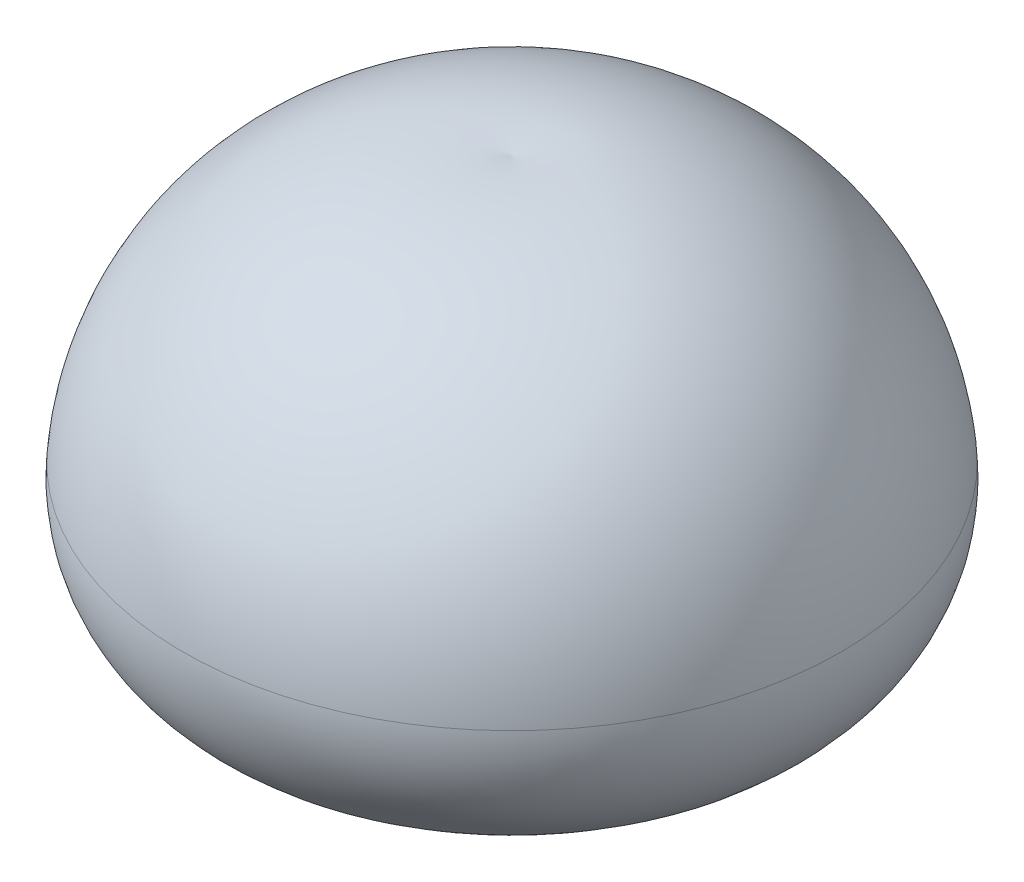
from build123d import *


with BuildPart() as part:
    # Sketch 1 → Revolve 1 (revolve)
    with BuildSketch(Plane.XY):
        with BuildLine():
            Line((0, 1824.872676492), (0, 3037.683553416))
            ThreePointArc((0, 3037.683553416), (1815.155855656, 2520.963037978), (2702.241375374, 855.168887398))
            ThreePointArc((2702.241375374, 855.168887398), (1791.553992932, -438.033910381), (363.484276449, 241.923345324))
            ThreePointArc((363.484276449, 241.923345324), (703.511128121, 584.33854285), (479.191996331, 1011.594150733))
            ThreePointArc((479.191996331, 1011.594150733), (481.545405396, 1450.465172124), (329.231194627, 1862.064119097))
            ThreePointArc((329.231194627, 1862.064119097), (163.344457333, 1854.720957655), (0, 1824.872676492))
        make_face()
    revolve(axis=Axis((0, 1824.872676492, 0), (0, 1, 0)))

    # Sketch 2 → Revolve 2 (revolve)
    with BuildSketch(Plane.XY, mode=Mode.PRIVATE) as revolve_2_sk:
        with BuildLine():
            Line((0, 1824.872676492), (0, 3037.683553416))
            ThreePointArc((0, 3037.683553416), (-1033.521595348, 2654.14278774), (-1788.348854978, 1850.708773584))
            ThreePointArc((-1788.348854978, 1850.708773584), (-1791.62181794, 629.995430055), (-739.392847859, 11.152983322))
            ThreePointArc((-739.392847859, 11.152983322), (-827.336720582, 1104.577470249), (0, 1824.872676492))
        make_face()
    revolve(revolve_2_sk.sketch.rotate(Axis((0, 1824.872676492, 0), (0, 1, 0)), 180), axis=Axis((0, 1824.872676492, 0), (0, 1, 0)))


solid = part.part
